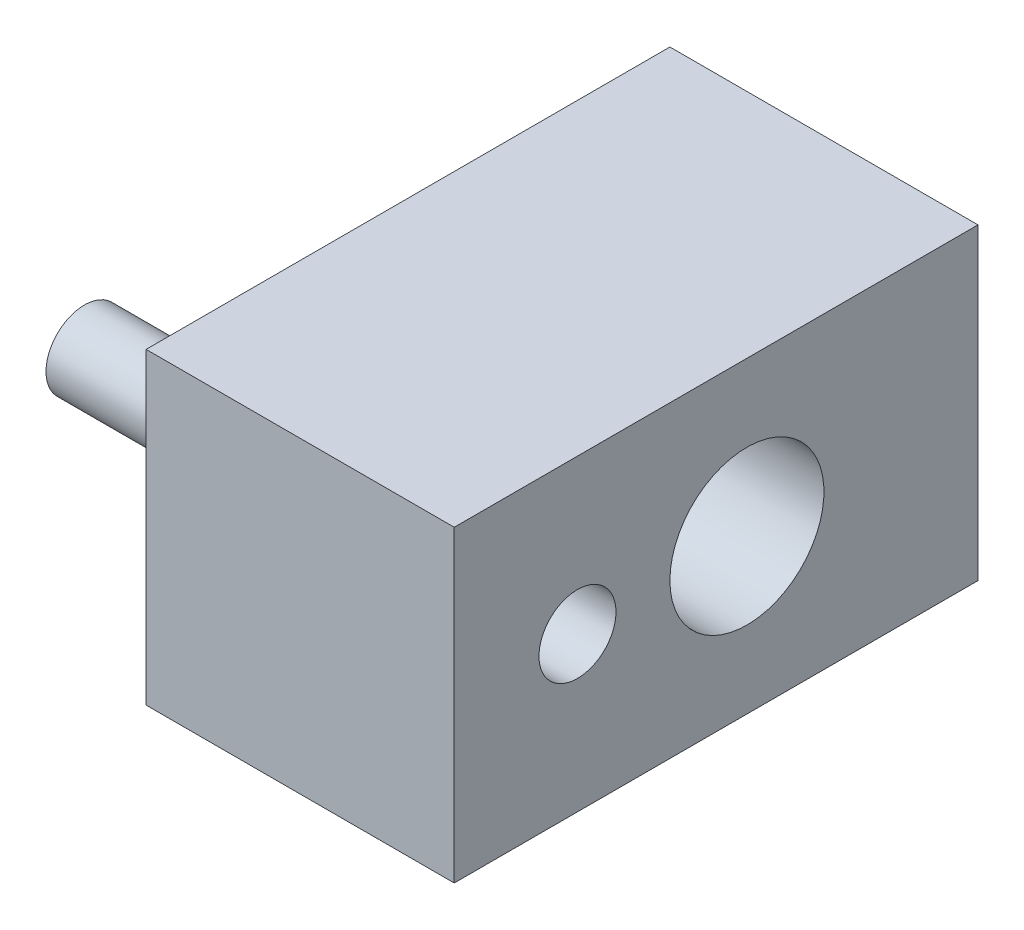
ISO-10303-21;
HEADER;
FILE_DESCRIPTION(('STEP AP214'),'2;1');
FILE_NAME('part.step','',(''),(''),'','','');
FILE_SCHEMA(('AUTOMOTIVE_DESIGN { 1 0 10303 214 1 1 1 1 }'));
ENDSEC;
DATA;
#1=APPLICATION_CONTEXT('core data for automotive mechanical design processes');
#2=APPLICATION_PROTOCOL_DEFINITION('international standard','automotive_design',2000,#1);
#3=PRODUCT_CONTEXT('',#1,'mechanical');
#4=PRODUCT('Part','Part','',(#3));
#5=PRODUCT_RELATED_PRODUCT_CATEGORY('part','',(#4));
#6=PRODUCT_DEFINITION_FORMATION('','',#4);
#7=PRODUCT_DEFINITION_CONTEXT('part definition',#1,'design');
#8=PRODUCT_DEFINITION('design','',#6,#7);
#9=PRODUCT_DEFINITION_SHAPE('','',#8);
#10=(LENGTH_UNIT() NAMED_UNIT(*) SI_UNIT(.MILLI.,.METRE.));
#11=(NAMED_UNIT(*) PLANE_ANGLE_UNIT() SI_UNIT($,.RADIAN.));
#12=(NAMED_UNIT(*) SI_UNIT($,.STERADIAN.) SOLID_ANGLE_UNIT());
#13=UNCERTAINTY_MEASURE_WITH_UNIT(LENGTH_MEASURE(1.E-05),#10,'distance_accuracy_value','');
#14=(GEOMETRIC_REPRESENTATION_CONTEXT(3) GLOBAL_UNCERTAINTY_ASSIGNED_CONTEXT((#13)) GLOBAL_UNIT_ASSIGNED_CONTEXT((#10,
#11,#12)) REPRESENTATION_CONTEXT('',''));
#15=CARTESIAN_POINT('',(0.,0.,0.));
#16=DIRECTION('',(0.,0.,1.));
#17=DIRECTION('',(1.,0.,0.));
#18=AXIS2_PLACEMENT_3D('',#15,#16,#17);
#19=CARTESIAN_POINT('',(-16.,5.,13.));
#20=DIRECTION('',(1.,0.,0.));
#21=DIRECTION('',(0.,0.,-1.));
#22=AXIS2_PLACEMENT_3D('',#19,#20,#21);
#23=CYLINDRICAL_SURFACE('',#22,1.25);
#24=CARTESIAN_POINT('',(-16.,5.,13.));
#25=DIRECTION('',(-1.,0.,0.));
#26=DIRECTION('',(0.,0.,1.));
#27=AXIS2_PLACEMENT_3D('',#24,#25,#26);
#28=CIRCLE('',#27,1.25);
#29=CARTESIAN_POINT('',(-16.,5.,14.25));
#30=VERTEX_POINT('',#29);
#31=EDGE_CURVE('E11',#30,#30,#28,.T.);
#32=ORIENTED_EDGE('',*,*,#31,.F.);
#33=EDGE_LOOP('',(#32));
#34=FACE_BOUND('',#33,.T.);
#35=CARTESIAN_POINT('',(-10.,5.,13.));
#36=DIRECTION('',(-1.,0.,0.));
#37=DIRECTION('',(0.,0.,1.));
#38=AXIS2_PLACEMENT_3D('',#35,#36,#37);
#39=CIRCLE('',#38,1.25);
#40=CARTESIAN_POINT('',(-10.,5.,14.25));
#41=VERTEX_POINT('',#40);
#42=EDGE_CURVE('E54',#41,#41,#39,.T.);
#43=ORIENTED_EDGE('',*,*,#42,.T.);
#44=EDGE_LOOP('',(#43));
#45=FACE_BOUND('',#44,.T.);
#46=ADVANCED_FACE('F51',(#34,#45),#23,.T.);
#47=CARTESIAN_POINT('',(-16.,5.,13.));
#48=DIRECTION('',(-1.,0.,0.));
#49=DIRECTION('',(0.,0.,1.));
#50=AXIS2_PLACEMENT_3D('',#47,#48,#49);
#51=PLANE('',#50);
#52=ORIENTED_EDGE('',*,*,#31,.T.);
#53=EDGE_LOOP('',(#52));
#54=FACE_BOUND('',#53,.T.);
#55=ADVANCED_FACE('F66',(#54),#51,.T.);
#56=CARTESIAN_POINT('',(-10.,5.,13.));
#57=DIRECTION('',(-1.,0.,0.));
#58=DIRECTION('',(0.,0.,1.));
#59=AXIS2_PLACEMENT_3D('',#56,#57,#58);
#60=PLANE('',#59);
#61=ORIENTED_EDGE('',*,*,#42,.F.);
#62=EDGE_LOOP('',(#61));
#63=FACE_BOUND('',#62,.T.);
#64=ADVANCED_FACE('F64',(#63),#60,.F.);
#65=CLOSED_SHELL('',(#46,#55,#64));
#66=MANIFOLD_SOLID_BREP('B2',#65);
#67=CARTESIAN_POINT('',(0.,0.,17.));
#68=DIRECTION('',(-1.,0.,0.));
#69=DIRECTION('',(0.,0.,1.));
#70=AXIS2_PLACEMENT_3D('',#67,#68,#69);
#71=PLANE('',#70);
#72=CARTESIAN_POINT('',(0.,5.,7.5));
#73=DIRECTION('',(-1.,0.,0.));
#74=DIRECTION('',(0.,0.,1.));
#75=AXIS2_PLACEMENT_3D('',#72,#73,#74);
#76=CIRCLE('',#75,2.5);
#77=CARTESIAN_POINT('',(0.,5.,10.));
#78=VERTEX_POINT('',#77);
#79=EDGE_CURVE('E163',#78,#78,#76,.T.);
#80=ORIENTED_EDGE('',*,*,#79,.T.);
#81=EDGE_LOOP('',(#80));
#82=FACE_BOUND('',#81,.T.);
#83=DIRECTION('',(0.,1.,0.));
#84=VECTOR('',#83,1.);
#85=CARTESIAN_POINT('',(0.,0.,0.));
#86=LINE('',#85,#84);
#87=CARTESIAN_POINT('',(0.,0.,0.));
#88=VERTEX_POINT('',#87);
#89=CARTESIAN_POINT('',(0.,10.,0.));
#90=VERTEX_POINT('',#89);
#91=EDGE_CURVE('E143',#88,#90,#86,.T.);
#92=ORIENTED_EDGE('',*,*,#91,.T.);
#93=DIRECTION('',(0.,0.,-1.));
#94=VECTOR('',#93,1.);
#95=CARTESIAN_POINT('',(0.,10.,17.));
#96=LINE('',#95,#94);
#97=CARTESIAN_POINT('',(0.,10.,17.));
#98=VERTEX_POINT('',#97);
#99=EDGE_CURVE('E49',#98,#90,#96,.T.);
#100=ORIENTED_EDGE('',*,*,#99,.F.);
#101=DIRECTION('',(0.,1.,0.));
#102=VECTOR('',#101,1.);
#103=CARTESIAN_POINT('',(0.,0.,17.));
#104=LINE('',#103,#102);
#105=CARTESIAN_POINT('',(0.,0.,17.));
#106=VERTEX_POINT('',#105);
#107=EDGE_CURVE('E172',#106,#98,#104,.T.);
#108=ORIENTED_EDGE('',*,*,#107,.F.);
#109=DIRECTION('',(0.,0.,-1.));
#110=VECTOR('',#109,1.);
#111=CARTESIAN_POINT('',(0.,0.,17.));
#112=LINE('',#111,#110);
#113=EDGE_CURVE('E157',#106,#88,#112,.T.);
#114=ORIENTED_EDGE('',*,*,#113,.T.);
#115=EDGE_LOOP('',(#92,#100,#108,#114));
#116=FACE_BOUND('',#115,.T.);
#117=CARTESIAN_POINT('',(0.,5.,13.));
#118=DIRECTION('',(1.,0.,0.));
#119=DIRECTION('',(0.,0.,-1.));
#120=AXIS2_PLACEMENT_3D('',#117,#118,#119);
#121=CIRCLE('',#120,1.24999999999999);
#122=CARTESIAN_POINT('',(0.,5.,11.75));
#123=VERTEX_POINT('',#122);
#124=EDGE_CURVE('E215',#123,#123,#121,.T.);
#125=ORIENTED_EDGE('',*,*,#124,.F.);
#126=EDGE_LOOP('',(#125));
#127=FACE_BOUND('',#126,.T.);
#128=ADVANCED_FACE('F92',(#82,#116,#127),#71,.F.);
#129=CARTESIAN_POINT('',(-10.,0.,17.));
#130=DIRECTION('',(1.,0.,0.));
#131=DIRECTION('',(0.,0.,-1.));
#132=AXIS2_PLACEMENT_3D('',#129,#130,#131);
#133=PLANE('',#132);
#134=CARTESIAN_POINT('',(-10.,5.,13.));
#135=DIRECTION('',(1.,0.,0.));
#136=DIRECTION('',(0.,0.,-1.));
#137=AXIS2_PLACEMENT_3D('',#134,#135,#136);
#138=CIRCLE('',#137,1.25);
#139=CARTESIAN_POINT('',(-10.,5.,11.75));
#140=VERTEX_POINT('',#139);
#141=EDGE_CURVE('E218',#140,#140,#138,.T.);
#142=ORIENTED_EDGE('',*,*,#141,.T.);
#143=EDGE_LOOP('',(#142));
#144=FACE_BOUND('',#143,.T.);
#145=DIRECTION('',(0.,-1.,0.));
#146=VECTOR('',#145,1.);
#147=CARTESIAN_POINT('',(-10.,0.,0.));
#148=LINE('',#147,#146);
#149=CARTESIAN_POINT('',(-10.,10.,0.));
#150=VERTEX_POINT('',#149);
#151=CARTESIAN_POINT('',(-10.,0.,0.));
#152=VERTEX_POINT('',#151);
#153=EDGE_CURVE('E144',#150,#152,#148,.T.);
#154=ORIENTED_EDGE('',*,*,#153,.T.);
#155=DIRECTION('',(0.,0.,-1.));
#156=VECTOR('',#155,1.);
#157=CARTESIAN_POINT('',(-10.,0.,17.));
#158=LINE('',#157,#156);
#159=CARTESIAN_POINT('',(-10.,0.,17.));
#160=VERTEX_POINT('',#159);
#161=EDGE_CURVE('E183',#160,#152,#158,.T.);
#162=ORIENTED_EDGE('',*,*,#161,.F.);
#163=DIRECTION('',(0.,-1.,0.));
#164=VECTOR('',#163,1.);
#165=CARTESIAN_POINT('',(-10.,0.,17.));
#166=LINE('',#165,#164);
#167=CARTESIAN_POINT('',(-10.,10.,17.));
#168=VERTEX_POINT('',#167);
#169=EDGE_CURVE('E118',#168,#160,#166,.T.);
#170=ORIENTED_EDGE('',*,*,#169,.F.);
#171=DIRECTION('',(0.,0.,-1.));
#172=VECTOR('',#171,1.);
#173=CARTESIAN_POINT('',(-10.,10.,17.));
#174=LINE('',#173,#172);
#175=EDGE_CURVE('E106',#168,#150,#174,.T.);
#176=ORIENTED_EDGE('',*,*,#175,.T.);
#177=EDGE_LOOP('',(#154,#162,#170,#176));
#178=FACE_BOUND('',#177,.T.);
#179=CARTESIAN_POINT('',(-10.,5.,7.5));
#180=DIRECTION('',(-1.,0.,0.));
#181=DIRECTION('',(0.,0.,1.));
#182=AXIS2_PLACEMENT_3D('',#179,#180,#181);
#183=CIRCLE('',#182,2.5);
#184=CARTESIAN_POINT('',(-10.,5.,10.));
#185=VERTEX_POINT('',#184);
#186=EDGE_CURVE('E159',#185,#185,#183,.T.);
#187=ORIENTED_EDGE('',*,*,#186,.F.);
#188=EDGE_LOOP('',(#187));
#189=FACE_BOUND('',#188,.T.);
#190=ADVANCED_FACE('F189',(#144,#178,#189),#133,.F.);
#191=CARTESIAN_POINT('',(0.,10.,17.));
#192=DIRECTION('',(0.,-1.,0.));
#193=DIRECTION('',(1.,0.,0.));
#194=AXIS2_PLACEMENT_3D('',#191,#192,#193);
#195=PLANE('',#194);
#196=DIRECTION('',(-1.,0.,0.));
#197=VECTOR('',#196,1.);
#198=CARTESIAN_POINT('',(0.,10.,0.));
#199=LINE('',#198,#197);
#200=EDGE_CURVE('E139',#90,#150,#199,.T.);
#201=ORIENTED_EDGE('',*,*,#200,.T.);
#202=ORIENTED_EDGE('',*,*,#175,.F.);
#203=DIRECTION('',(-1.,0.,0.));
#204=VECTOR('',#203,1.);
#205=CARTESIAN_POINT('',(0.,10.,17.));
#206=LINE('',#205,#204);
#207=EDGE_CURVE('E152',#98,#168,#206,.T.);
#208=ORIENTED_EDGE('',*,*,#207,.F.);
#209=ORIENTED_EDGE('',*,*,#99,.T.);
#210=EDGE_LOOP('',(#201,#202,#208,#209));
#211=FACE_BOUND('',#210,.T.);
#212=ADVANCED_FACE('F151',(#211),#195,.F.);
#213=CARTESIAN_POINT('',(0.,0.,17.));
#214=DIRECTION('',(0.,1.,0.));
#215=DIRECTION('',(-1.,0.,0.));
#216=AXIS2_PLACEMENT_3D('',#213,#214,#215);
#217=PLANE('',#216);
#218=DIRECTION('',(1.,0.,0.));
#219=VECTOR('',#218,1.);
#220=CARTESIAN_POINT('',(0.,0.,0.));
#221=LINE('',#220,#219);
#222=EDGE_CURVE('E169',#152,#88,#221,.T.);
#223=ORIENTED_EDGE('',*,*,#222,.T.);
#224=ORIENTED_EDGE('',*,*,#113,.F.);
#225=DIRECTION('',(1.,0.,0.));
#226=VECTOR('',#225,1.);
#227=CARTESIAN_POINT('',(0.,0.,17.));
#228=LINE('',#227,#226);
#229=EDGE_CURVE('E113',#160,#106,#228,.T.);
#230=ORIENTED_EDGE('',*,*,#229,.F.);
#231=ORIENTED_EDGE('',*,*,#161,.T.);
#232=EDGE_LOOP('',(#223,#224,#230,#231));
#233=FACE_BOUND('',#232,.T.);
#234=ADVANCED_FACE('F192',(#233),#217,.F.);
#235=CARTESIAN_POINT('',(0.,0.,17.));
#236=DIRECTION('',(0.,0.,1.));
#237=DIRECTION('',(1.,0.,0.));
#238=AXIS2_PLACEMENT_3D('',#235,#236,#237);
#239=PLANE('',#238);
#240=ORIENTED_EDGE('',*,*,#107,.T.);
#241=ORIENTED_EDGE('',*,*,#207,.T.);
#242=ORIENTED_EDGE('',*,*,#169,.T.);
#243=ORIENTED_EDGE('',*,*,#229,.T.);
#244=EDGE_LOOP('',(#240,#241,#242,#243));
#245=FACE_BOUND('',#244,.T.);
#246=ADVANCED_FACE('F193',(#245),#239,.T.);
#247=CARTESIAN_POINT('',(0.,0.,0.));
#248=DIRECTION('',(0.,0.,1.));
#249=DIRECTION('',(1.,0.,0.));
#250=AXIS2_PLACEMENT_3D('',#247,#248,#249);
#251=PLANE('',#250);
#252=CARTESIAN_POINT('',(-5.,5.,0.));
#253=DIRECTION('',(0.,0.,-1.));
#254=DIRECTION('',(-1.,0.,0.));
#255=AXIS2_PLACEMENT_3D('',#252,#253,#254);
#256=CIRCLE('',#255,1.65);
#257=CARTESIAN_POINT('',(-6.65,5.,0.));
#258=VERTEX_POINT('',#257);
#259=EDGE_CURVE('E224',#258,#258,#256,.T.);
#260=ORIENTED_EDGE('',*,*,#259,.F.);
#261=EDGE_LOOP('',(#260));
#262=FACE_BOUND('',#261,.T.);
#263=ORIENTED_EDGE('',*,*,#91,.F.);
#264=ORIENTED_EDGE('',*,*,#222,.F.);
#265=ORIENTED_EDGE('',*,*,#153,.F.);
#266=ORIENTED_EDGE('',*,*,#200,.F.);
#267=EDGE_LOOP('',(#263,#264,#265,#266));
#268=FACE_BOUND('',#267,.T.);
#269=ADVANCED_FACE('F140',(#262,#268),#251,.F.);
#270=CARTESIAN_POINT('',(-10.,5.,7.5));
#271=DIRECTION('',(1.,0.,0.));
#272=DIRECTION('',(0.,0.,-1.));
#273=AXIS2_PLACEMENT_3D('',#270,#271,#272);
#274=CYLINDRICAL_SURFACE('',#273,2.5);
#275=CARTESIAN_POINT('',(-6.65,5.,5.));
#276=CARTESIAN_POINT('',(-6.64999873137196,4.91694260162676,5.00000126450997));
#277=CARTESIAN_POINT('',(-6.64369332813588,4.83387293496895,5.00417590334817));
#278=CARTESIAN_POINT('',(-6.61885588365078,4.67037243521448,5.02046206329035));
#279=CARTESIAN_POINT('',(-6.60031631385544,4.58994325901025,5.03257847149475));
#280=CARTESIAN_POINT('',(-6.55213728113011,4.43433320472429,5.06354921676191));
#281=CARTESIAN_POINT('',(-6.52254993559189,4.35912962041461,5.08237189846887));
#282=CARTESIAN_POINT('',(-6.45352693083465,4.21504904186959,5.12523480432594));
#283=CARTESIAN_POINT('',(-6.4140899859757,4.14617287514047,5.1492757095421));
#284=CARTESIAN_POINT('',(-6.32286952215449,4.01016313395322,5.20304338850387));
#285=CARTESIAN_POINT('',(-6.27032656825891,3.94366330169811,5.23307831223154));
#286=CARTESIAN_POINT('',(-6.15618952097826,3.81981714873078,5.29501154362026));
#287=CARTESIAN_POINT('',(-6.09458262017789,3.76248402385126,5.32691244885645));
#288=CARTESIAN_POINT('',(-5.95302539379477,3.649568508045,5.39493215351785));
#289=CARTESIAN_POINT('',(-5.87171133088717,3.59561789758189,5.43094323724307));
#290=CARTESIAN_POINT('',(-5.69912083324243,3.50223006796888,5.49750748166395));
#291=CARTESIAN_POINT('',(-5.60786198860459,3.46276774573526,5.52807003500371));
#292=CARTESIAN_POINT('',(-5.44413560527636,3.40927509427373,5.57115995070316));
#293=CARTESIAN_POINT('',(-5.37369396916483,3.391204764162,5.58634429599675));
#294=CARTESIAN_POINT('',(-5.2299018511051,3.36446600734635,5.60914156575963));
#295=CARTESIAN_POINT('',(-5.15655644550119,3.35578186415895,5.61676714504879));
#296=CARTESIAN_POINT('',(-5.00867667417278,3.34835738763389,5.62327248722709));
#297=CARTESIAN_POINT('',(-4.93413884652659,3.3496550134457,5.62211886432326));
#298=CARTESIAN_POINT('',(-4.78652353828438,3.36218889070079,5.6111810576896));
#299=CARTESIAN_POINT('',(-4.7134473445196,3.37343353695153,5.60138958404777));
#300=CARTESIAN_POINT('',(-4.57363241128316,3.4044937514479,5.57522853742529));
#301=CARTESIAN_POINT('',(-4.50675695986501,3.4239457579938,5.55913987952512));
#302=CARTESIAN_POINT('',(-4.37715045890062,3.47052089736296,5.52222991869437));
#303=CARTESIAN_POINT('',(-4.31442077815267,3.4976465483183,5.50140706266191));
#304=CARTESIAN_POINT('',(-4.18145090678,3.56504440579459,5.45232655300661));
#305=CARTESIAN_POINT('',(-4.11223771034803,3.60686345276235,5.42341588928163));
#306=CARTESIAN_POINT('',(-3.9810080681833,3.69975793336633,5.36401818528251));
#307=CARTESIAN_POINT('',(-3.91900059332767,3.75084470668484,5.33352924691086));
#308=CARTESIAN_POINT('',(-3.79079581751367,3.87318324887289,5.26704742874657));
#309=CARTESIAN_POINT('',(-3.72638563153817,3.94642027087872,5.23122080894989));
#310=CARTESIAN_POINT('',(-3.61069375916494,4.1045148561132,5.16430895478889));
#311=CARTESIAN_POINT('',(-3.55939926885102,4.18936096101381,5.13321910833));
#312=CARTESIAN_POINT('',(-3.48076937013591,4.35126057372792,5.08446418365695));
#313=CARTESIAN_POINT('',(-3.45070429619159,4.42655359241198,5.06536086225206));
#314=CARTESIAN_POINT('',(-3.40174403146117,4.58202394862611,5.0339165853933));
#315=CARTESIAN_POINT('',(-3.38283949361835,4.66219713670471,5.02156997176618));
#316=CARTESIAN_POINT('',(-3.35714787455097,4.82563324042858,5.00473096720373));
#317=CARTESIAN_POINT('',(-3.35041003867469,4.9089073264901,5.00027049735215));
#318=CARTESIAN_POINT('',(-3.34962658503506,5.07554547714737,4.99975367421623));
#319=CARTESIAN_POINT('',(-3.35558054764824,5.15890953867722,5.00369704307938));
#320=CARTESIAN_POINT('',(-3.37899822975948,5.31759099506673,5.01905723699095));
#321=CARTESIAN_POINT('',(-3.39567875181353,5.39307690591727,5.0299651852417));
#322=CARTESIAN_POINT('',(-3.43896514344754,5.5399400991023,5.05785818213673));
#323=CARTESIAN_POINT('',(-3.46557260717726,5.61131671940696,5.07484420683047));
#324=CARTESIAN_POINT('',(-3.52968198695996,5.75306190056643,5.11490711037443));
#325=CARTESIAN_POINT('',(-3.56777480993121,5.82306998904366,5.13830561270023));
#326=CARTESIAN_POINT('',(-3.65282892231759,5.95596244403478,5.18889612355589));
#327=CARTESIAN_POINT('',(-3.69979606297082,6.01884206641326,5.21609063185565));
#328=CARTESIAN_POINT('',(-3.80961080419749,6.14612838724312,5.27691400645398));
#329=CARTESIAN_POINT('',(-3.87379416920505,6.20922126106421,5.31088232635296));
#330=CARTESIAN_POINT('',(-4.01166557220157,6.32429793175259,5.37851672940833));
#331=CARTESIAN_POINT('',(-4.08535908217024,6.37627528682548,5.41218262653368));
#332=CARTESIAN_POINT('',(-4.23370339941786,6.46353640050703,5.4725409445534));
#333=CARTESIAN_POINT('',(-4.30752954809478,6.49996651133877,5.49959392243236));
#334=CARTESIAN_POINT('',(-4.4614963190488,6.56184713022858,5.54752140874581));
#335=CARTESIAN_POINT('',(-4.54162522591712,6.58731746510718,5.56840705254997));
#336=CARTESIAN_POINT('',(-4.69279856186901,6.62268199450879,5.59806726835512));
#337=CARTESIAN_POINT('',(-4.76310833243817,6.63447382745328,5.60828682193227));
#338=CARTESIAN_POINT('',(-4.90533882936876,6.64882828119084,5.62078129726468));
#339=CARTESIAN_POINT('',(-4.97725794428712,6.65139975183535,5.6230638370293));
#340=CARTESIAN_POINT('',(-5.12059113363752,6.64714925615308,5.61933394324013));
#341=CARTESIAN_POINT('',(-5.19200519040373,6.64032696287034,5.61332122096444));
#342=CARTESIAN_POINT('',(-5.33240243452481,6.61773943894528,5.59392209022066));
#343=CARTESIAN_POINT('',(-5.40138228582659,6.60196240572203,5.58052595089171));
#344=CARTESIAN_POINT('',(-5.55417079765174,6.55672361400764,5.54355481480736));
#345=CARTESIAN_POINT('',(-5.63677236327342,6.52467713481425,5.51818558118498));
#346=CARTESIAN_POINT('',(-5.79439420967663,6.44883296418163,5.46208337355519));
#347=CARTESIAN_POINT('',(-5.86940375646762,6.40501894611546,5.43134296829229));
#348=CARTESIAN_POINT('',(-6.01234437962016,6.30588975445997,5.36735067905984));
#349=CARTESIAN_POINT('',(-6.08013166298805,6.25038987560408,5.3340647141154));
#350=CARTESIAN_POINT('',(-6.20635347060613,6.1291028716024,5.26843437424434));
#351=CARTESIAN_POINT('',(-6.2647853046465,6.06331279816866,5.23609027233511));
#352=CARTESIAN_POINT('',(-6.37783171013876,5.91322410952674,5.171155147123));
#353=CARTESIAN_POINT('',(-6.43103774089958,5.82763791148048,5.13904646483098));
#354=CARTESIAN_POINT('',(-6.52162979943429,5.64604949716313,5.08306219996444));
#355=CARTESIAN_POINT('',(-6.55904531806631,5.55006712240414,5.05917128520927));
#356=CARTESIAN_POINT('',(-6.60788092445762,5.3780291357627,5.02764430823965));
#357=CARTESIAN_POINT('',(-6.62360538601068,5.30366474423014,5.01735345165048));
#358=CARTESIAN_POINT('',(-6.64466271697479,5.15286961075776,5.00353253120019));
#359=CARTESIAN_POINT('',(-6.65000116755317,5.07644000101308,4.99999883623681));
#360=CARTESIAN_POINT('',(-6.65,5.,5.));
#361=B_SPLINE_CURVE_WITH_KNOTS('',3,(#275,#276,#277,#278,#279,#280,#281,#282,#283,#284,#285,
#286,#287,#288,#289,#290,#291,#292,#293,#294,#295,#296,#297,#298,#299,#300,#301,#302,#303,#304,
#305,#306,#307,#308,#309,#310,#311,#312,#313,#314,#315,#316,#317,#318,#319,#320,#321,#322,#323,
#324,#325,#326,#327,#328,#329,#330,#331,#332,#333,#334,#335,#336,#337,#338,#339,#340,#341,#342,
#343,#344,#345,#346,#347,#348,#349,#350,#351,#352,#353,#354,#355,#356,#357,#358,#359,#360),
.UNSPECIFIED.,.T.,.F.,(4,2,2,2,2,2,2,2,2,2,2,2,2,2,2,2,2,2,2,2,2,2,2,2,2,2,2,2,2,2,2,2,2,2,2,2,
2,2,2,2,2,2,4),(0.,0.248863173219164,0.497879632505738,0.745735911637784,0.993624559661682,
1.26236142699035,1.53148173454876,1.84208059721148,2.15213873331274,2.37412103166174,
2.59573105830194,2.81818424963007,3.0408253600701,3.25449658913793,3.4682380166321,
3.7249687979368,3.98201585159,4.2922411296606,4.60216239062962,4.8509948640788,5.09961864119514,
5.34924649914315,5.5988661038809,5.83205917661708,6.06528971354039,6.31352952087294,
6.5619335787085,6.84938688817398,7.13700633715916,7.39601090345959,7.65454492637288,
7.86965548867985,8.08455952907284,8.29947104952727,8.51466648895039,8.78967221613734,
9.06506148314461,9.34518323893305,9.62538540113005,9.94089155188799,10.2558058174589,
10.484964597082,10.7140001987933),.UNSPECIFIED.);
#362=CARTESIAN_POINT('',(-6.65,5.,5.));
#363=VERTEX_POINT('',#362);
#364=EDGE_CURVE('E95',#363,#363,#361,.T.);
#365=ORIENTED_EDGE('',*,*,#364,.F.);
#366=EDGE_LOOP('',(#365));
#367=FACE_BOUND('',#366,.T.);
#368=ORIENTED_EDGE('',*,*,#186,.T.);
#369=EDGE_LOOP('',(#368));
#370=FACE_BOUND('',#369,.T.);
#371=ORIENTED_EDGE('',*,*,#79,.F.);
#372=EDGE_LOOP('',(#371));
#373=FACE_BOUND('',#372,.T.);
#374=ADVANCED_FACE('F200',(#367,#370,#373),#274,.F.);
#375=CARTESIAN_POINT('',(0.,5.,13.));
#376=DIRECTION('',(1.,0.,0.));
#377=DIRECTION('',(0.,0.,-1.));
#378=AXIS2_PLACEMENT_3D('',#375,#376,#377);
#379=CYLINDRICAL_SURFACE('',#378,1.24999999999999);
#380=ORIENTED_EDGE('',*,*,#141,.F.);
#381=EDGE_LOOP('',(#380));
#382=FACE_BOUND('',#381,.T.);
#383=ORIENTED_EDGE('',*,*,#124,.T.);
#384=EDGE_LOOP('',(#383));
#385=FACE_BOUND('',#384,.T.);
#386=ADVANCED_FACE('F237',(#382,#385),#379,.F.);
#387=CARTESIAN_POINT('',(-5.,5.,0.));
#388=DIRECTION('',(0.,0.,-1.));
#389=DIRECTION('',(-1.,0.,0.));
#390=AXIS2_PLACEMENT_3D('',#387,#388,#389);
#391=CYLINDRICAL_SURFACE('',#390,1.65);
#392=ORIENTED_EDGE('',*,*,#364,.T.);
#393=EDGE_LOOP('',(#392));
#394=FACE_BOUND('',#393,.T.);
#395=ORIENTED_EDGE('',*,*,#259,.T.);
#396=EDGE_LOOP('',(#395));
#397=FACE_BOUND('',#396,.T.);
#398=ADVANCED_FACE('F233',(#394,#397),#391,.F.);
#399=CLOSED_SHELL('',(#128,#190,#212,#234,#246,#269,#374,#386,#398));
#400=MANIFOLD_SOLID_BREP('B6',#399);
#401=ADVANCED_BREP_SHAPE_REPRESENTATION('',(#18,#66,#400),#14);
#402=SHAPE_DEFINITION_REPRESENTATION(#9,#401);
ENDSEC;
END-ISO-10303-21;
